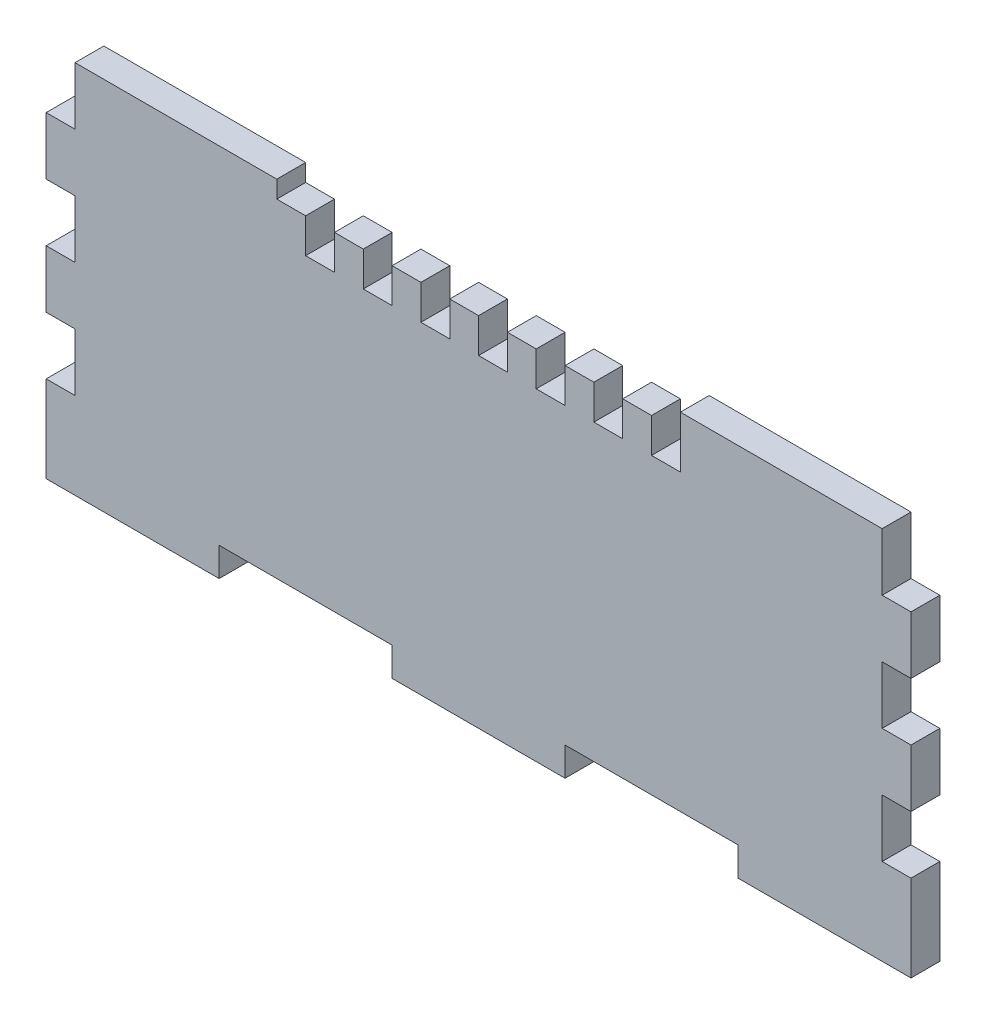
from build123d import *

# Parameters (mm, degrees)
SKETCH1_W               = 381
SKETCH1_H               = 152.4
BOSS_EXTRUDE1_DEPTH     = 12.7
SKETCH2_W               = 76.2
SKETCH2_H               = 12.7
BOSS_EXTRUDE2_DEPTH     = 12.7
CUT_EXTRUDE1_DEPTH      = 411.546038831
CUT_EXTRUDE1_DEPTH_BACK = 411.546038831
SKETCH3_W               = 12.7
SKETCH3_H               = 25.4
SKETCH4_W               = 12.7
SKETCH4_H               = 22.86
CUT_EXTRUDE2_DEPTH      = 12.7
SKETCH5_W               = 12.7
SKETCH5_H               = 7.62
CUT_EXTRUDE3_DEPTH      = 12.7


with BuildPart() as part:
    # Sketch1 → Boss-Extrude1 (new body)
    with BuildSketch(Plane.XY):
        with Locations((190.5, 76.2)):
            Rectangle(SKETCH1_W, SKETCH1_H)
    extrude(amount=BOSS_EXTRUDE1_DEPTH)

    # Sketch2 → Boss-Extrude2 (add)
    with BuildSketch(Plane.XZ):
        with Locations((38.1, 6.35)):
            Rectangle(SKETCH2_W, SKETCH2_H)
        with Locations((190.5, 6.35)):
            Rectangle(SKETCH2_W, SKETCH2_H)
        with Locations((342.9, 6.35)):
            Rectangle(SKETCH2_W, SKETCH2_H)
    extrude(amount=BOSS_EXTRUDE2_DEPTH)

    # Sketch3 → Cut-Extrude1 (cut, two sides: drawn at the far end of the back side and taken through both)
    with BuildSketch(Plane.XY.offset(12.7).offset(-CUT_EXTRUDE1_DEPTH_BACK)):
        with Locations((6.35, 139.7)):
            Rectangle(SKETCH3_W, SKETCH3_H)
        with Locations((6.35, 88.9)):
            Rectangle(SKETCH3_W, SKETCH3_H)
        with Locations((6.35, 38.1)):
            Rectangle(SKETCH3_W, SKETCH3_H)
        with Locations((374.65, 38.1)):
            Rectangle(SKETCH3_W, SKETCH3_H)
        with Locations((374.65, 88.9)):
            Rectangle(SKETCH3_W, SKETCH3_H)
        with Locations((374.65, 139.7)):
            Rectangle(SKETCH3_W, SKETCH3_H)
    extrude(amount=CUT_EXTRUDE1_DEPTH + CUT_EXTRUDE1_DEPTH_BACK, mode=Mode.SUBTRACT)

    # Sketch4 → Cut-Extrude2 (cut)
    with BuildSketch(Plane(origin=(0, 0, 0), x_dir=(-1, 0, 0), z_dir=(0, 0, -1))):
        with Locations((-273.05, 140.97)):
            Rectangle(SKETCH4_W, SKETCH4_H)
        with Locations((-247.65, 140.97)):
            Rectangle(SKETCH4_W, SKETCH4_H)
        with Locations((-222.25, 140.97)):
            Rectangle(SKETCH4_W, SKETCH4_H)
        with Locations((-196.85, 140.97)):
            Rectangle(SKETCH4_W, SKETCH4_H)
        with Locations((-171.45, 140.97)):
            Rectangle(SKETCH4_W, SKETCH4_H)
        with Locations((-146.05, 140.97)):
            Rectangle(SKETCH4_W, SKETCH4_H)
        with Locations((-120.65, 140.97)):
            Rectangle(SKETCH4_W, SKETCH4_H)
    extrude(amount=-CUT_EXTRUDE2_DEPTH, mode=Mode.SUBTRACT)

    # Sketch5 → Cut-Extrude3 (cut)
    with BuildSketch(Plane(origin=(0, 0, 0), x_dir=(-1, 0, 0), z_dir=(0, 0, -1))):
        with Locations((-260.35, 148.59)):
            Rectangle(SKETCH5_W, SKETCH5_H)
        with Locations((-234.95, 148.59)):
            Rectangle(SKETCH5_W, SKETCH5_H)
        with Locations((-209.55, 148.59)):
            Rectangle(SKETCH5_W, SKETCH5_H)
        with Locations((-184.15, 148.59)):
            Rectangle(SKETCH5_W, SKETCH5_H)
        with Locations((-158.75, 148.59)):
            Rectangle(SKETCH5_W, SKETCH5_H)
        with Locations((-107.95, 148.59)):
            Rectangle(SKETCH5_W, SKETCH5_H)
        with Locations((-133.35, 148.59)):
            Rectangle(SKETCH5_W, SKETCH5_H)
    extrude(amount=-CUT_EXTRUDE3_DEPTH, mode=Mode.SUBTRACT)


solid = part.part
